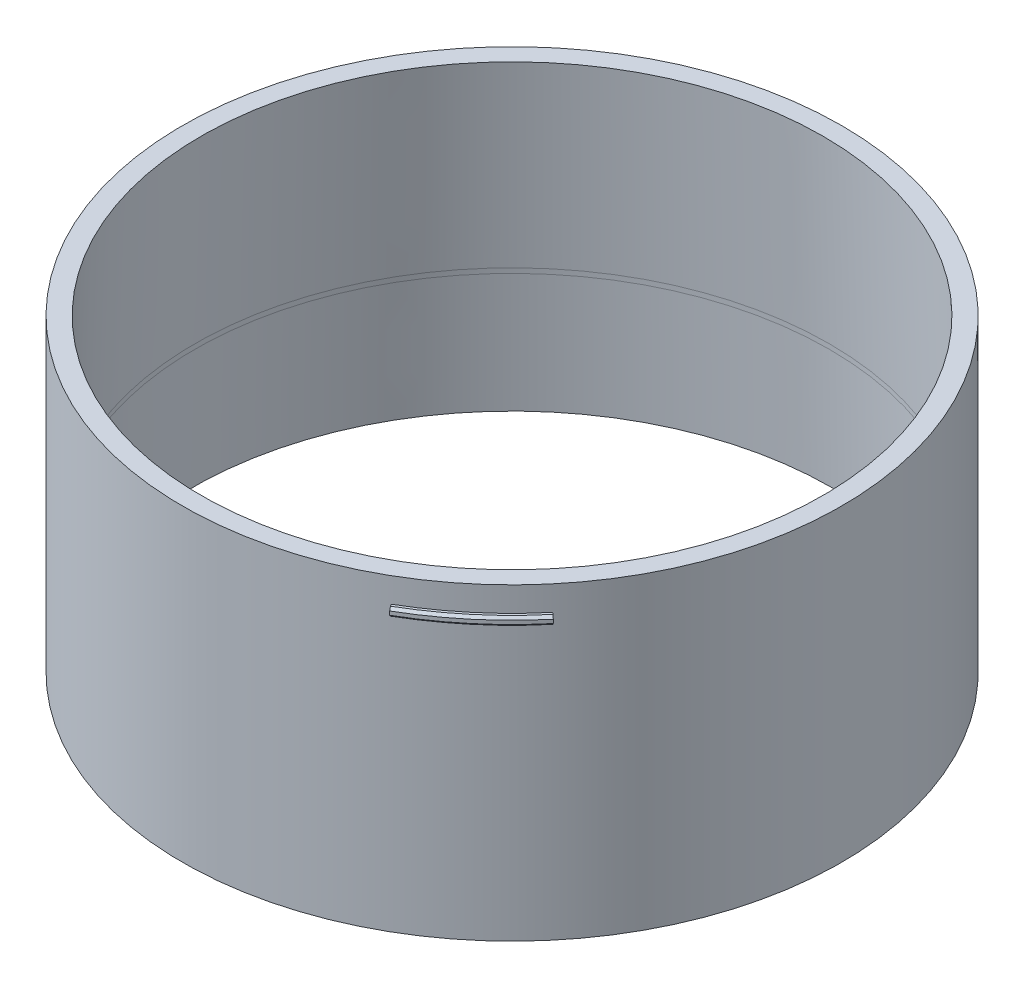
ISO-10303-21;
HEADER;
FILE_DESCRIPTION(('STEP AP214'),'2;1');
FILE_NAME('part.step','',(''),(''),'','','');
FILE_SCHEMA(('AUTOMOTIVE_DESIGN { 1 0 10303 214 1 1 1 1 }'));
ENDSEC;
DATA;
#1=APPLICATION_CONTEXT('core data for automotive mechanical design processes');
#2=APPLICATION_PROTOCOL_DEFINITION('international standard','automotive_design',2000,#1);
#3=PRODUCT_CONTEXT('',#1,'mechanical');
#4=PRODUCT('Part','Part','',(#3));
#5=PRODUCT_RELATED_PRODUCT_CATEGORY('part','',(#4));
#6=PRODUCT_DEFINITION_FORMATION('','',#4);
#7=PRODUCT_DEFINITION_CONTEXT('part definition',#1,'design');
#8=PRODUCT_DEFINITION('design','',#6,#7);
#9=PRODUCT_DEFINITION_SHAPE('','',#8);
#10=(LENGTH_UNIT() NAMED_UNIT(*) SI_UNIT(.MILLI.,.METRE.));
#11=(NAMED_UNIT(*) PLANE_ANGLE_UNIT() SI_UNIT($,.RADIAN.));
#12=(NAMED_UNIT(*) SI_UNIT($,.STERADIAN.) SOLID_ANGLE_UNIT());
#13=UNCERTAINTY_MEASURE_WITH_UNIT(LENGTH_MEASURE(1.E-05),#10,'distance_accuracy_value','');
#14=(GEOMETRIC_REPRESENTATION_CONTEXT(3) GLOBAL_UNCERTAINTY_ASSIGNED_CONTEXT((#13)) GLOBAL_UNIT_ASSIGNED_CONTEXT((#10,
#11,#12)) REPRESENTATION_CONTEXT('',''));
#15=CARTESIAN_POINT('',(0.,0.,0.));
#16=DIRECTION('',(0.,0.,1.));
#17=DIRECTION('',(1.,0.,0.));
#18=AXIS2_PLACEMENT_3D('',#15,#16,#17);
#19=CARTESIAN_POINT('',(0.,0.,0.));
#20=DIRECTION('',(0.,-1.,0.));
#21=DIRECTION('',(0.,0.,-1.));
#22=AXIS2_PLACEMENT_3D('',#19,#20,#21);
#23=CYLINDRICAL_SURFACE('',#22,26.7);
#24=CARTESIAN_POINT('',(0.,60.,0.));
#25=DIRECTION('',(0.,-1.,0.));
#26=DIRECTION('',(0.,0.,-1.));
#27=AXIS2_PLACEMENT_3D('',#24,#25,#26);
#28=CIRCLE('',#27,26.7);
#29=CARTESIAN_POINT('',(0.,60.,-26.7));
#30=VERTEX_POINT('',#29);
#31=EDGE_CURVE('E342',#30,#30,#28,.T.);
#32=ORIENTED_EDGE('',*,*,#31,.T.);
#33=EDGE_LOOP('',(#32));
#34=FACE_BOUND('',#33,.T.);
#35=CARTESIAN_POINT('',(0.,35.,0.));
#36=DIRECTION('',(0.,-1.,0.));
#37=DIRECTION('',(0.,0.,-1.));
#38=AXIS2_PLACEMENT_3D('',#35,#36,#37);
#39=CIRCLE('',#38,26.7);
#40=CARTESIAN_POINT('',(0.,35.,-26.7));
#41=VERTEX_POINT('',#40);
#42=EDGE_CURVE('E338',#41,#41,#39,.T.);
#43=ORIENTED_EDGE('',*,*,#42,.F.);
#44=EDGE_LOOP('',(#43));
#45=FACE_BOUND('',#44,.T.);
#46=CARTESIAN_POINT('',(0.,58.,0.));
#47=DIRECTION('',(0.,-1.,0.));
#48=DIRECTION('',(0.,0.,-1.));
#49=AXIS2_PLACEMENT_3D('',#46,#47,#48);
#50=CIRCLE('',#49,26.7);
#51=CARTESIAN_POINT('',(-26.7,58.,0.));
#52=VERTEX_POINT('',#51);
#53=CARTESIAN_POINT('',(-25.0897929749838,58.,9.13193782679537));
#54=VERTEX_POINT('',#53);
#55=EDGE_CURVE('E358',#52,#54,#50,.F.);
#56=ORIENTED_EDGE('',*,*,#55,.T.);
#57=DIRECTION('',(0.,-1.,0.));
#58=VECTOR('',#57,1.);
#59=CARTESIAN_POINT('',(-25.0897929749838,0.,9.13193782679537));
#60=LINE('',#59,#58);
#61=CARTESIAN_POINT('',(-25.0897929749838,57.3,9.13193782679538));
#62=VERTEX_POINT('',#61);
#63=EDGE_CURVE('E364',#54,#62,#60,.T.);
#64=ORIENTED_EDGE('',*,*,#63,.T.);
#65=CARTESIAN_POINT('',(0.,57.3,0.));
#66=DIRECTION('',(0.,1.,0.));
#67=DIRECTION('',(0.,0.,1.));
#68=AXIS2_PLACEMENT_3D('',#65,#66,#67);
#69=CIRCLE('',#68,26.7);
#70=CARTESIAN_POINT('',(-26.7,57.3,0.));
#71=VERTEX_POINT('',#70);
#72=EDGE_CURVE('E361',#62,#71,#69,.F.);
#73=ORIENTED_EDGE('',*,*,#72,.T.);
#74=DIRECTION('',(0.,-1.,0.));
#75=VECTOR('',#74,1.);
#76=CARTESIAN_POINT('',(-26.7,0.,0.));
#77=LINE('',#76,#75);
#78=EDGE_CURVE('E354',#52,#71,#77,.T.);
#79=ORIENTED_EDGE('',*,*,#78,.F.);
#80=EDGE_LOOP('',(#56,#64,#73,#79));
#81=FACE_BOUND('',#80,.T.);
#82=CARTESIAN_POINT('',(0.,58.,0.));
#83=DIRECTION('',(0.,-1.,0.));
#84=DIRECTION('',(0.,0.,-1.));
#85=AXIS2_PLACEMENT_3D('',#82,#83,#84);
#86=CIRCLE('',#85,26.7);
#87=CARTESIAN_POINT('',(13.3500000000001,58.,-23.1228782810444));
#88=VERTEX_POINT('',#87);
#89=CARTESIAN_POINT('',(4.63640634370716,58.,-26.2943670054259));
#90=VERTEX_POINT('',#89);
#91=EDGE_CURVE('E371',#88,#90,#86,.F.);
#92=ORIENTED_EDGE('',*,*,#91,.T.);
#93=DIRECTION('',(0.,-1.,0.));
#94=VECTOR('',#93,1.);
#95=CARTESIAN_POINT('',(4.63640634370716,0.,-26.2943670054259));
#96=LINE('',#95,#94);
#97=CARTESIAN_POINT('',(4.63640634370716,57.3,-26.2943670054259));
#98=VERTEX_POINT('',#97);
#99=EDGE_CURVE('E377',#90,#98,#96,.T.);
#100=ORIENTED_EDGE('',*,*,#99,.T.);
#101=CARTESIAN_POINT('',(0.,57.3,0.));
#102=DIRECTION('',(0.,1.,0.));
#103=DIRECTION('',(0.,0.,1.));
#104=AXIS2_PLACEMENT_3D('',#101,#102,#103);
#105=CIRCLE('',#104,26.7);
#106=CARTESIAN_POINT('',(13.3500000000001,57.3,-23.1228782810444));
#107=VERTEX_POINT('',#106);
#108=EDGE_CURVE('E374',#98,#107,#105,.F.);
#109=ORIENTED_EDGE('',*,*,#108,.T.);
#110=DIRECTION('',(0.,-1.,0.));
#111=VECTOR('',#110,1.);
#112=CARTESIAN_POINT('',(13.3500000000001,0.,-23.1228782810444));
#113=LINE('',#112,#111);
#114=EDGE_CURVE('E367',#88,#107,#113,.T.);
#115=ORIENTED_EDGE('',*,*,#114,.F.);
#116=EDGE_LOOP('',(#92,#100,#109,#115));
#117=FACE_BOUND('',#116,.T.);
#118=CARTESIAN_POINT('',(0.,58.,0.));
#119=DIRECTION('',(0.,-1.,0.));
#120=DIRECTION('',(0.,0.,-1.));
#121=AXIS2_PLACEMENT_3D('',#118,#119,#120);
#122=CIRCLE('',#121,26.7);
#123=CARTESIAN_POINT('',(13.3499999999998,58.,23.1228782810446));
#124=VERTEX_POINT('',#123);
#125=CARTESIAN_POINT('',(20.4533866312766,58.,17.1624291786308));
#126=VERTEX_POINT('',#125);
#127=EDGE_CURVE('E61',#124,#126,#122,.F.);
#128=ORIENTED_EDGE('',*,*,#127,.T.);
#129=DIRECTION('',(0.,-1.,0.));
#130=VECTOR('',#129,1.);
#131=CARTESIAN_POINT('',(20.4533866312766,0.,17.1624291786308));
#132=LINE('',#131,#130);
#133=CARTESIAN_POINT('',(20.4533866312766,57.3,17.1624291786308));
#134=VERTEX_POINT('',#133);
#135=EDGE_CURVE('E11',#126,#134,#132,.T.);
#136=ORIENTED_EDGE('',*,*,#135,.T.);
#137=CARTESIAN_POINT('',(0.,57.3,0.));
#138=DIRECTION('',(0.,1.,0.));
#139=DIRECTION('',(0.,0.,1.));
#140=AXIS2_PLACEMENT_3D('',#137,#138,#139);
#141=CIRCLE('',#140,26.7);
#142=CARTESIAN_POINT('',(13.3499999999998,57.3,23.1228782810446));
#143=VERTEX_POINT('',#142);
#144=EDGE_CURVE('E51',#134,#143,#141,.F.);
#145=ORIENTED_EDGE('',*,*,#144,.T.);
#146=DIRECTION('',(0.,-1.,0.));
#147=VECTOR('',#146,1.);
#148=CARTESIAN_POINT('',(13.3499999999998,0.,23.1228782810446));
#149=LINE('',#148,#147);
#150=EDGE_CURVE('E380',#124,#143,#149,.T.);
#151=ORIENTED_EDGE('',*,*,#150,.F.);
#152=EDGE_LOOP('',(#128,#136,#145,#151));
#153=FACE_BOUND('',#152,.T.);
#154=ADVANCED_FACE('F42',(#34,#45,#81,#117,#153),#23,.T.);
#155=CARTESIAN_POINT('',(25.2,60.,0.));
#156=DIRECTION('',(0.,1.,0.));
#157=DIRECTION('',(0.,0.,1.));
#158=AXIS2_PLACEMENT_3D('',#155,#156,#157);
#159=PLANE('',#158);
#160=CARTESIAN_POINT('',(0.,60.,0.));
#161=DIRECTION('',(0.,-1.,0.));
#162=DIRECTION('',(0.,0.,-1.));
#163=AXIS2_PLACEMENT_3D('',#160,#161,#162);
#164=CIRCLE('',#163,25.2);
#165=CARTESIAN_POINT('',(0.,60.,-25.2));
#166=VERTEX_POINT('',#165);
#167=EDGE_CURVE('E330',#166,#166,#164,.T.);
#168=ORIENTED_EDGE('',*,*,#167,.T.);
#169=EDGE_LOOP('',(#168));
#170=FACE_BOUND('',#169,.T.);
#171=ORIENTED_EDGE('',*,*,#31,.F.);
#172=EDGE_LOOP('',(#171));
#173=FACE_BOUND('',#172,.T.);
#174=ADVANCED_FACE('F407',(#170,#173),#159,.T.);
#175=CARTESIAN_POINT('',(25.9,35.,0.));
#176=DIRECTION('',(0.,-1.,0.));
#177=DIRECTION('',(0.,0.,-1.));
#178=AXIS2_PLACEMENT_3D('',#175,#176,#177);
#179=PLANE('',#178);
#180=ORIENTED_EDGE('',*,*,#42,.T.);
#181=EDGE_LOOP('',(#180));
#182=FACE_BOUND('',#181,.T.);
#183=CARTESIAN_POINT('',(0.,35.,0.));
#184=DIRECTION('',(0.,-1.,0.));
#185=DIRECTION('',(0.,0.,-1.));
#186=AXIS2_PLACEMENT_3D('',#183,#184,#185);
#187=CIRCLE('',#186,25.9);
#188=CARTESIAN_POINT('',(0.,35.,-25.9));
#189=VERTEX_POINT('',#188);
#190=EDGE_CURVE('E334',#189,#189,#187,.T.);
#191=ORIENTED_EDGE('',*,*,#190,.F.);
#192=EDGE_LOOP('',(#191));
#193=FACE_BOUND('',#192,.T.);
#194=ADVANCED_FACE('F413',(#182,#193),#179,.T.);
#195=CARTESIAN_POINT('',(0.,44.9979997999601,0.));
#196=DIRECTION('',(0.,-1.,0.));
#197=DIRECTION('',(0.,0.,-1.));
#198=AXIS2_PLACEMENT_3D('',#195,#196,#197);
#199=CONICAL_SURFACE('',#198,25.7,0.0200013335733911);
#200=CARTESIAN_POINT('',(0.,44.7983084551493,0.));
#201=DIRECTION('',(0.,-1.,0.));
#202=DIRECTION('',(0.,0.,-1.));
#203=AXIS2_PLACEMENT_3D('',#200,#201,#202);
#204=CIRCLE('',#203,25.7039946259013);
#205=CARTESIAN_POINT('',(0.,44.7983084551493,-25.7039946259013));
#206=VERTEX_POINT('',#205);
#207=EDGE_CURVE('E350',#206,#206,#204,.F.);
#208=ORIENTED_EDGE('',*,*,#207,.T.);
#209=EDGE_LOOP('',(#208));
#210=FACE_BOUND('',#209,.T.);
#211=ORIENTED_EDGE('',*,*,#190,.T.);
#212=EDGE_LOOP('',(#211));
#213=FACE_BOUND('',#212,.T.);
#214=ADVANCED_FACE('F419',(#210,#213),#199,.F.);
#215=CARTESIAN_POINT('',(0.,60.,0.));
#216=DIRECTION('',(0.,-1.,0.));
#217=DIRECTION('',(0.,0.,-1.));
#218=AXIS2_PLACEMENT_3D('',#215,#216,#217);
#219=CONICAL_SURFACE('',#218,25.2,0.033316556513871);
#220=CARTESIAN_POINT('',(0.,45.1976202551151,0.));
#221=DIRECTION('',(0.,-1.,0.));
#222=DIRECTION('',(0.,0.,-1.));
#223=AXIS2_PLACEMENT_3D('',#220,#221,#222);
#224=CIRCLE('',#223,25.6933468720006);
#225=CARTESIAN_POINT('',(0.,45.1976202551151,-25.6933468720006));
#226=VERTEX_POINT('',#225);
#227=EDGE_CURVE('E346',#226,#226,#224,.T.);
#228=ORIENTED_EDGE('',*,*,#227,.T.);
#229=EDGE_LOOP('',(#228));
#230=FACE_BOUND('',#229,.T.);
#231=ORIENTED_EDGE('',*,*,#167,.F.);
#232=EDGE_LOOP('',(#231));
#233=FACE_BOUND('',#232,.T.);
#234=ADVANCED_FACE('F423',(#230,#233),#219,.F.);
#235=CARTESIAN_POINT('',(0.,44.1983084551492,0.));
#236=DIRECTION('',(0.,-1.,0.));
#237=DIRECTION('',(0.,0.,-1.));
#238=AXIS2_PLACEMENT_3D('',#235,#236,#237);
#239=DEGENERATE_TOROIDAL_SURFACE('',#238,4.29000477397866,30.,.F.);
#240=ORIENTED_EDGE('',*,*,#207,.F.);
#241=EDGE_LOOP('',(#240));
#242=FACE_BOUND('',#241,.T.);
#243=ORIENTED_EDGE('',*,*,#227,.F.);
#244=EDGE_LOOP('',(#243));
#245=FACE_BOUND('',#244,.T.);
#246=ADVANCED_FACE('F44',(#242,#245),#239,.T.);
#247=CARTESIAN_POINT('',(-24.4469244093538,57.3,8.89795280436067));
#248=DIRECTION('',(0.,1.,0.));
#249=DIRECTION('',(0.,0.,1.));
#250=AXIS2_PLACEMENT_3D('',#247,#248,#249);
#251=PLANE('',#250);
#252=ORIENTED_EDGE('',*,*,#72,.F.);
#253=DIRECTION('',(0.939692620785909,0.,-0.342020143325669));
#254=VECTOR('',#253,1.);
#255=CARTESIAN_POINT('',(-24.4469244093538,57.3,8.89795280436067));
#256=LINE('',#255,#254);
#257=CARTESIAN_POINT('',(-25.277731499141,57.3,9.20034185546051));
#258=VERTEX_POINT('',#257);
#259=EDGE_CURVE('E313',#258,#62,#256,.T.);
#260=ORIENTED_EDGE('',*,*,#259,.F.);
#261=CARTESIAN_POINT('',(0.,57.3,0.));
#262=DIRECTION('',(0.,-1.,0.));
#263=DIRECTION('',(0.,0.,-1.));
#264=AXIS2_PLACEMENT_3D('',#261,#262,#263);
#265=CIRCLE('',#264,26.9);
#266=CARTESIAN_POINT('',(-26.9,57.3,0.));
#267=VERTEX_POINT('',#266);
#268=EDGE_CURVE('E327',#258,#267,#265,.T.);
#269=ORIENTED_EDGE('',*,*,#268,.T.);
#270=DIRECTION('',(1.,0.,0.));
#271=VECTOR('',#270,1.);
#272=CARTESIAN_POINT('',(-26.0158735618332,57.3,0.));
#273=LINE('',#272,#271);
#274=EDGE_CURVE('E294',#267,#71,#273,.T.);
#275=ORIENTED_EDGE('',*,*,#274,.T.);
#276=EDGE_LOOP('',(#252,#260,#269,#275));
#277=FACE_BOUND('',#276,.T.);
#278=ADVANCED_FACE('F428',(#277),#251,.F.);
#279=CARTESIAN_POINT('',(0.,57.5,0.));
#280=DIRECTION('',(0.,1.,0.));
#281=DIRECTION('',(0.,0.,1.));
#282=AXIS2_PLACEMENT_3D('',#279,#280,#281);
#283=CONICAL_SURFACE('',#282,27.1,0.785398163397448);
#284=CARTESIAN_POINT('',(0.,57.5,0.));
#285=DIRECTION('',(0.,-1.,0.));
#286=DIRECTION('',(0.,0.,-1.));
#287=AXIS2_PLACEMENT_3D('',#284,#285,#286);
#288=CIRCLE('',#287,27.1);
#289=CARTESIAN_POINT('',(-25.4656700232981,57.5,9.26874588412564));
#290=VERTEX_POINT('',#289);
#291=CARTESIAN_POINT('',(-27.1,57.5,0.));
#292=VERTEX_POINT('',#291);
#293=EDGE_CURVE('E324',#290,#292,#288,.T.);
#294=ORIENTED_EDGE('',*,*,#293,.T.);
#295=DIRECTION('',(0.707106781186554,-0.707106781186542,0.));
#296=VECTOR('',#295,1.);
#297=CARTESIAN_POINT('',(-26.9,57.3,0.));
#298=LINE('',#297,#296);
#299=EDGE_CURVE('E290',#292,#267,#298,.T.);
#300=ORIENTED_EDGE('',*,*,#299,.T.);
#301=ORIENTED_EDGE('',*,*,#268,.F.);
#302=DIRECTION('',(0.664463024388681,-0.707106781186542,-0.241844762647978));
#303=VECTOR('',#302,1.);
#304=CARTESIAN_POINT('',(-25.277731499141,57.3,9.20034185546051));
#305=LINE('',#304,#303);
#306=EDGE_CURVE('E309',#290,#258,#305,.T.);
#307=ORIENTED_EDGE('',*,*,#306,.F.);
#308=EDGE_LOOP('',(#294,#300,#301,#307));
#309=FACE_BOUND('',#308,.T.);
#310=ADVANCED_FACE('F431',(#309),#283,.T.);
#311=CARTESIAN_POINT('',(0.,54.1622707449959,0.));
#312=DIRECTION('',(0.,-1.,0.));
#313=DIRECTION('',(0.,0.,-1.));
#314=AXIS2_PLACEMENT_3D('',#311,#312,#313);
#315=CYLINDRICAL_SURFACE('',#314,27.1);
#316=CARTESIAN_POINT('',(0.,57.8,0.));
#317=DIRECTION('',(0.,-1.,0.));
#318=DIRECTION('',(0.,0.,-1.));
#319=AXIS2_PLACEMENT_3D('',#316,#317,#318);
#320=CIRCLE('',#319,27.1);
#321=CARTESIAN_POINT('',(-25.4656700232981,57.8,9.26874588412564));
#322=VERTEX_POINT('',#321);
#323=CARTESIAN_POINT('',(-27.1,57.8,0.));
#324=VERTEX_POINT('',#323);
#325=EDGE_CURVE('E321',#322,#324,#320,.T.);
#326=ORIENTED_EDGE('',*,*,#325,.T.);
#327=DIRECTION('',(0.,-1.,0.));
#328=VECTOR('',#327,1.);
#329=CARTESIAN_POINT('',(-27.1,57.8,0.));
#330=LINE('',#329,#328);
#331=EDGE_CURVE('E286',#324,#292,#330,.T.);
#332=ORIENTED_EDGE('',*,*,#331,.T.);
#333=ORIENTED_EDGE('',*,*,#293,.F.);
#334=DIRECTION('',(0.,-1.,0.));
#335=VECTOR('',#334,1.);
#336=CARTESIAN_POINT('',(-25.4656700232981,57.8,9.26874588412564));
#337=LINE('',#336,#335);
#338=EDGE_CURVE('E305',#322,#290,#337,.T.);
#339=ORIENTED_EDGE('',*,*,#338,.F.);
#340=EDGE_LOOP('',(#326,#332,#333,#339));
#341=FACE_BOUND('',#340,.T.);
#342=ADVANCED_FACE('F435',(#341),#315,.T.);
#343=CARTESIAN_POINT('',(0.,58.,0.));
#344=DIRECTION('',(0.,-1.,0.));
#345=DIRECTION('',(0.,0.,-1.));
#346=AXIS2_PLACEMENT_3D('',#343,#344,#345);
#347=CONICAL_SURFACE('',#346,26.9,0.785398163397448);
#348=CARTESIAN_POINT('',(0.,58.,0.));
#349=DIRECTION('',(0.,-1.,0.));
#350=DIRECTION('',(0.,0.,-1.));
#351=AXIS2_PLACEMENT_3D('',#348,#349,#350);
#352=CIRCLE('',#351,26.9);
#353=CARTESIAN_POINT('',(-25.277731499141,58.,9.2003418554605));
#354=VERTEX_POINT('',#353);
#355=CARTESIAN_POINT('',(-26.9,58.0000000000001,0.));
#356=VERTEX_POINT('',#355);
#357=EDGE_CURVE('E317',#354,#356,#352,.T.);
#358=ORIENTED_EDGE('',*,*,#357,.T.);
#359=DIRECTION('',(-0.707106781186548,-0.707106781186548,0.));
#360=VECTOR('',#359,1.);
#361=CARTESIAN_POINT('',(-26.9,58.0000000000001,0.));
#362=LINE('',#361,#360);
#363=EDGE_CURVE('E282',#356,#324,#362,.T.);
#364=ORIENTED_EDGE('',*,*,#363,.T.);
#365=ORIENTED_EDGE('',*,*,#325,.F.);
#366=DIRECTION('',(-0.664463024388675,-0.707106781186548,0.241844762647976));
#367=VECTOR('',#366,1.);
#368=CARTESIAN_POINT('',(-25.277731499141,58.,9.2003418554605));
#369=LINE('',#368,#367);
#370=EDGE_CURVE('E301',#354,#322,#369,.T.);
#371=ORIENTED_EDGE('',*,*,#370,.F.);
#372=EDGE_LOOP('',(#358,#364,#365,#371));
#373=FACE_BOUND('',#372,.T.);
#374=ADVANCED_FACE('F439',(#373),#347,.T.);
#375=CARTESIAN_POINT('',(-25.277731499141,58.,9.2003418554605));
#376=DIRECTION('',(0.,-1.,0.));
#377=DIRECTION('',(0.,0.,-1.));
#378=AXIS2_PLACEMENT_3D('',#375,#376,#377);
#379=PLANE('',#378);
#380=ORIENTED_EDGE('',*,*,#55,.F.);
#381=DIRECTION('',(-1.,0.,0.));
#382=VECTOR('',#381,1.);
#383=CARTESIAN_POINT('',(-26.9,58.0000000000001,0.));
#384=LINE('',#383,#382);
#385=EDGE_CURVE('E279',#52,#356,#384,.T.);
#386=ORIENTED_EDGE('',*,*,#385,.T.);
#387=ORIENTED_EDGE('',*,*,#357,.F.);
#388=DIRECTION('',(-0.939692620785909,0.,0.342020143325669));
#389=VECTOR('',#388,1.);
#390=CARTESIAN_POINT('',(-25.277731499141,58.,9.2003418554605));
#391=LINE('',#390,#389);
#392=EDGE_CURVE('E298',#54,#354,#391,.T.);
#393=ORIENTED_EDGE('',*,*,#392,.F.);
#394=EDGE_LOOP('',(#380,#386,#387,#393));
#395=FACE_BOUND('',#394,.T.);
#396=ADVANCED_FACE('F443',(#395),#379,.F.);
#397=CARTESIAN_POINT('',(0.,0.,0.));
#398=DIRECTION('',(-0.342020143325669,0.,-0.939692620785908));
#399=DIRECTION('',(-0.939692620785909,0.,0.342020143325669));
#400=AXIS2_PLACEMENT_3D('',#397,#398,#399);
#401=PLANE('',#400);
#402=ORIENTED_EDGE('',*,*,#63,.F.);
#403=ORIENTED_EDGE('',*,*,#392,.T.);
#404=ORIENTED_EDGE('',*,*,#370,.T.);
#405=ORIENTED_EDGE('',*,*,#338,.T.);
#406=ORIENTED_EDGE('',*,*,#306,.T.);
#407=ORIENTED_EDGE('',*,*,#259,.T.);
#408=EDGE_LOOP('',(#402,#403,#404,#405,#406,#407));
#409=FACE_BOUND('',#408,.T.);
#410=ADVANCED_FACE('F447',(#409),#401,.F.);
#411=CARTESIAN_POINT('',(0.,0.,0.));
#412=DIRECTION('',(0.,0.,-1.));
#413=DIRECTION('',(-1.,0.,0.));
#414=AXIS2_PLACEMENT_3D('',#411,#412,#413);
#415=PLANE('',#414);
#416=ORIENTED_EDGE('',*,*,#385,.F.);
#417=ORIENTED_EDGE('',*,*,#78,.T.);
#418=ORIENTED_EDGE('',*,*,#274,.F.);
#419=ORIENTED_EDGE('',*,*,#299,.F.);
#420=ORIENTED_EDGE('',*,*,#331,.F.);
#421=ORIENTED_EDGE('',*,*,#363,.F.);
#422=EDGE_LOOP('',(#416,#417,#418,#419,#420,#421));
#423=FACE_BOUND('',#422,.T.);
#424=ADVANCED_FACE('F451',(#423),#415,.T.);
#425=CARTESIAN_POINT('',(4.51760903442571,57.3,-25.6206339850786));
#426=DIRECTION('',(0.,1.,0.));
#427=DIRECTION('',(-0.866025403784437,0.,-0.500000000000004));
#428=AXIS2_PLACEMENT_3D('',#425,#426,#427);
#429=PLANE('',#428);
#430=ORIENTED_EDGE('',*,*,#108,.F.);
#431=DIRECTION('',(-0.173648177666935,0.,0.984807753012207));
#432=VECTOR('',#431,1.);
#433=CARTESIAN_POINT('',(4.51760903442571,57.3,-25.6206339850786));
#434=LINE('',#433,#432);
#435=CARTESIAN_POINT('',(4.67113597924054,57.3,-26.4913285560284));
#436=VERTEX_POINT('',#435);
#437=EDGE_CURVE('E262',#436,#98,#434,.T.);
#438=ORIENTED_EDGE('',*,*,#437,.F.);
#439=CARTESIAN_POINT('',(0.,57.3,0.));
#440=DIRECTION('',(0.,-1.,0.));
#441=DIRECTION('',(0.866025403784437,0.,0.500000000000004));
#442=AXIS2_PLACEMENT_3D('',#439,#440,#441);
#443=CIRCLE('',#442,26.9);
#444=CARTESIAN_POINT('',(13.4500000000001,57.3,-23.2960833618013));
#445=VERTEX_POINT('',#444);
#446=EDGE_CURVE('E276',#436,#445,#443,.T.);
#447=ORIENTED_EDGE('',*,*,#446,.T.);
#448=DIRECTION('',(-0.500000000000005,0.,0.866025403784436));
#449=VECTOR('',#448,1.);
#450=CARTESIAN_POINT('',(13.0079367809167,57.3,-22.5304074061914));
#451=LINE('',#450,#449);
#452=EDGE_CURVE('E243',#445,#107,#451,.T.);
#453=ORIENTED_EDGE('',*,*,#452,.T.);
#454=EDGE_LOOP('',(#430,#438,#447,#453));
#455=FACE_BOUND('',#454,.T.);
#456=ADVANCED_FACE('F455',(#455),#429,.F.);
#457=CARTESIAN_POINT('',(0.,57.5,0.));
#458=DIRECTION('',(0.,1.,0.));
#459=DIRECTION('',(-0.866025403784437,0.,-0.500000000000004));
#460=AXIS2_PLACEMENT_3D('',#457,#458,#459);
#461=CONICAL_SURFACE('',#460,27.1,0.785398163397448);
#462=CARTESIAN_POINT('',(0.,57.5,0.));
#463=DIRECTION('',(0.,-1.,0.));
#464=DIRECTION('',(0.866025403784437,0.,0.500000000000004));
#465=AXIS2_PLACEMENT_3D('',#462,#463,#464);
#466=CIRCLE('',#465,27.1);
#467=CARTESIAN_POINT('',(4.70586561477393,57.5,-26.6882901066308));
#468=VERTEX_POINT('',#467);
#469=CARTESIAN_POINT('',(13.5500000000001,57.5,-23.4692884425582));
#470=VERTEX_POINT('',#469);
#471=EDGE_CURVE('E273',#468,#470,#466,.T.);
#472=ORIENTED_EDGE('',*,*,#471,.T.);
#473=DIRECTION('',(-0.35355339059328,-0.707106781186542,0.612372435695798));
#474=VECTOR('',#473,1.);
#475=CARTESIAN_POINT('',(13.4500000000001,57.3,-23.2960833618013));
#476=LINE('',#475,#474);
#477=EDGE_CURVE('E239',#470,#445,#476,.T.);
#478=ORIENTED_EDGE('',*,*,#477,.T.);
#479=ORIENTED_EDGE('',*,*,#446,.F.);
#480=DIRECTION('',(-0.122787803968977,-0.707106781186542,0.696364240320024));
#481=VECTOR('',#480,1.);
#482=CARTESIAN_POINT('',(4.67113597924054,57.3,-26.4913285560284));
#483=LINE('',#482,#481);
#484=EDGE_CURVE('E258',#468,#436,#483,.T.);
#485=ORIENTED_EDGE('',*,*,#484,.F.);
#486=EDGE_LOOP('',(#472,#478,#479,#485));
#487=FACE_BOUND('',#486,.T.);
#488=ADVANCED_FACE('F459',(#487),#461,.T.);
#489=CARTESIAN_POINT('',(0.,54.1622707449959,0.));
#490=DIRECTION('',(0.,-1.,0.));
#491=DIRECTION('',(0.866025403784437,0.,0.500000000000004));
#492=AXIS2_PLACEMENT_3D('',#489,#490,#491);
#493=CYLINDRICAL_SURFACE('',#492,27.1);
#494=CARTESIAN_POINT('',(0.,57.8,0.));
#495=DIRECTION('',(0.,-1.,0.));
#496=DIRECTION('',(0.866025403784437,0.,0.500000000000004));
#497=AXIS2_PLACEMENT_3D('',#494,#495,#496);
#498=CIRCLE('',#497,27.1);
#499=CARTESIAN_POINT('',(4.70586561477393,57.8,-26.6882901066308));
#500=VERTEX_POINT('',#499);
#501=CARTESIAN_POINT('',(13.5500000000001,57.8,-23.4692884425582));
#502=VERTEX_POINT('',#501);
#503=EDGE_CURVE('E270',#500,#502,#498,.T.);
#504=ORIENTED_EDGE('',*,*,#503,.T.);
#505=DIRECTION('',(0.,-1.,0.));
#506=VECTOR('',#505,1.);
#507=CARTESIAN_POINT('',(13.5500000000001,57.8,-23.4692884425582));
#508=LINE('',#507,#506);
#509=EDGE_CURVE('E235',#502,#470,#508,.T.);
#510=ORIENTED_EDGE('',*,*,#509,.T.);
#511=ORIENTED_EDGE('',*,*,#471,.F.);
#512=DIRECTION('',(0.,-1.,0.));
#513=VECTOR('',#512,1.);
#514=CARTESIAN_POINT('',(4.70586561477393,57.8,-26.6882901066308));
#515=LINE('',#514,#513);
#516=EDGE_CURVE('E254',#500,#468,#515,.T.);
#517=ORIENTED_EDGE('',*,*,#516,.F.);
#518=EDGE_LOOP('',(#504,#510,#511,#517));
#519=FACE_BOUND('',#518,.T.);
#520=ADVANCED_FACE('F463',(#519),#493,.T.);
#521=CARTESIAN_POINT('',(0.,58.,0.));
#522=DIRECTION('',(0.,-1.,0.));
#523=DIRECTION('',(0.866025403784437,0.,0.500000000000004));
#524=AXIS2_PLACEMENT_3D('',#521,#522,#523);
#525=CONICAL_SURFACE('',#524,26.9,0.785398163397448);
#526=CARTESIAN_POINT('',(0.,58.,0.));
#527=DIRECTION('',(0.,-1.,0.));
#528=DIRECTION('',(0.866025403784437,0.,0.500000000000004));
#529=AXIS2_PLACEMENT_3D('',#526,#527,#528);
#530=CIRCLE('',#529,26.9);
#531=CARTESIAN_POINT('',(4.67113597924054,58.,-26.4913285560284));
#532=VERTEX_POINT('',#531);
#533=CARTESIAN_POINT('',(13.4500000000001,58.,-23.2960833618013));
#534=VERTEX_POINT('',#533);
#535=EDGE_CURVE('E266',#532,#534,#530,.T.);
#536=ORIENTED_EDGE('',*,*,#535,.T.);
#537=DIRECTION('',(0.353553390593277,-0.707106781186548,-0.612372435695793));
#538=VECTOR('',#537,1.);
#539=CARTESIAN_POINT('',(13.4500000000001,58.,-23.2960833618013));
#540=LINE('',#539,#538);
#541=EDGE_CURVE('E231',#534,#502,#540,.T.);
#542=ORIENTED_EDGE('',*,*,#541,.T.);
#543=ORIENTED_EDGE('',*,*,#503,.F.);
#544=DIRECTION('',(0.122787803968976,-0.707106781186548,-0.696364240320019));
#545=VECTOR('',#544,1.);
#546=CARTESIAN_POINT('',(4.67113597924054,58.,-26.4913285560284));
#547=LINE('',#546,#545);
#548=EDGE_CURVE('E250',#532,#500,#547,.T.);
#549=ORIENTED_EDGE('',*,*,#548,.F.);
#550=EDGE_LOOP('',(#536,#542,#543,#549));
#551=FACE_BOUND('',#550,.T.);
#552=ADVANCED_FACE('F467',(#551),#525,.T.);
#553=CARTESIAN_POINT('',(4.67113597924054,58.,-26.4913285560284));
#554=DIRECTION('',(0.,-1.,0.));
#555=DIRECTION('',(0.866025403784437,0.,0.500000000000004));
#556=AXIS2_PLACEMENT_3D('',#553,#554,#555);
#557=PLANE('',#556);
#558=ORIENTED_EDGE('',*,*,#91,.F.);
#559=DIRECTION('',(0.500000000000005,0.,-0.866025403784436));
#560=VECTOR('',#559,1.);
#561=CARTESIAN_POINT('',(13.4500000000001,58.,-23.2960833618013));
#562=LINE('',#561,#560);
#563=EDGE_CURVE('E228',#88,#534,#562,.T.);
#564=ORIENTED_EDGE('',*,*,#563,.T.);
#565=ORIENTED_EDGE('',*,*,#535,.F.);
#566=DIRECTION('',(0.173648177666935,0.,-0.984807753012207));
#567=VECTOR('',#566,1.);
#568=CARTESIAN_POINT('',(4.67113597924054,58.,-26.4913285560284));
#569=LINE('',#568,#567);
#570=EDGE_CURVE('E247',#90,#532,#569,.T.);
#571=ORIENTED_EDGE('',*,*,#570,.F.);
#572=EDGE_LOOP('',(#558,#564,#565,#571));
#573=FACE_BOUND('',#572,.T.);
#574=ADVANCED_FACE('F471',(#573),#557,.F.);
#575=CARTESIAN_POINT('',(0.,0.,0.));
#576=DIRECTION('',(0.984807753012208,0.,0.173648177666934));
#577=DIRECTION('',(0.173648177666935,0.,-0.984807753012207));
#578=AXIS2_PLACEMENT_3D('',#575,#576,#577);
#579=PLANE('',#578);
#580=ORIENTED_EDGE('',*,*,#99,.F.);
#581=ORIENTED_EDGE('',*,*,#570,.T.);
#582=ORIENTED_EDGE('',*,*,#548,.T.);
#583=ORIENTED_EDGE('',*,*,#516,.T.);
#584=ORIENTED_EDGE('',*,*,#484,.T.);
#585=ORIENTED_EDGE('',*,*,#437,.T.);
#586=EDGE_LOOP('',(#580,#581,#582,#583,#584,#585));
#587=FACE_BOUND('',#586,.T.);
#588=ADVANCED_FACE('F475',(#587),#579,.F.);
#589=CARTESIAN_POINT('',(0.,0.,0.));
#590=DIRECTION('',(0.866025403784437,0.,0.500000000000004));
#591=DIRECTION('',(0.500000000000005,0.,-0.866025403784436));
#592=AXIS2_PLACEMENT_3D('',#589,#590,#591);
#593=PLANE('',#592);
#594=ORIENTED_EDGE('',*,*,#563,.F.);
#595=ORIENTED_EDGE('',*,*,#114,.T.);
#596=ORIENTED_EDGE('',*,*,#452,.F.);
#597=ORIENTED_EDGE('',*,*,#477,.F.);
#598=ORIENTED_EDGE('',*,*,#509,.F.);
#599=ORIENTED_EDGE('',*,*,#541,.F.);
#600=EDGE_LOOP('',(#594,#595,#596,#597,#598,#599));
#601=FACE_BOUND('',#600,.T.);
#602=ADVANCED_FACE('F479',(#601),#593,.T.);
#603=CARTESIAN_POINT('',(19.9293153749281,57.3,16.7226811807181));
#604=DIRECTION('',(0.,1.,0.));
#605=DIRECTION('',(0.866025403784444,0.,-0.499999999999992));
#606=AXIS2_PLACEMENT_3D('',#603,#604,#605);
#607=PLANE('',#606);
#608=ORIENTED_EDGE('',*,*,#144,.F.);
#609=DIRECTION('',(-0.766044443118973,0.,-0.642787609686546));
#610=VECTOR('',#609,1.);
#611=CARTESIAN_POINT('',(19.9293153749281,57.3,16.7226811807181));
#612=LINE('',#611,#610);
#613=CARTESIAN_POINT('',(20.6065955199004,57.3,17.2909867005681));
#614=VERTEX_POINT('',#613);
#615=EDGE_CURVE('E184',#614,#134,#612,.T.);
#616=ORIENTED_EDGE('',*,*,#615,.F.);
#617=CARTESIAN_POINT('',(0.,57.3,0.));
#618=DIRECTION('',(0.,-1.,0.));
#619=DIRECTION('',(-0.866025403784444,0.,0.499999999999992));
#620=AXIS2_PLACEMENT_3D('',#617,#618,#619);
#621=CIRCLE('',#620,26.9);
#622=CARTESIAN_POINT('',(13.4499999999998,57.3,23.2960833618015));
#623=VERTEX_POINT('',#622);
#624=EDGE_CURVE('E225',#614,#623,#621,.T.);
#625=ORIENTED_EDGE('',*,*,#624,.T.);
#626=DIRECTION('',(-0.499999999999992,0.,-0.866025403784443));
#627=VECTOR('',#626,1.);
#628=CARTESIAN_POINT('',(13.0079367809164,57.3,22.5304074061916));
#629=LINE('',#628,#627);
#630=EDGE_CURVE('E200',#623,#143,#629,.T.);
#631=ORIENTED_EDGE('',*,*,#630,.T.);
#632=EDGE_LOOP('',(#608,#616,#625,#631));
#633=FACE_BOUND('',#632,.T.);
#634=ADVANCED_FACE('F389',(#633),#607,.F.);
#635=CARTESIAN_POINT('',(0.,57.5,0.));
#636=DIRECTION('',(0.,1.,0.));
#637=DIRECTION('',(0.866025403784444,0.,-0.499999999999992));
#638=AXIS2_PLACEMENT_3D('',#635,#636,#637);
#639=CONICAL_SURFACE('',#638,27.1,0.785398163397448);
#640=CARTESIAN_POINT('',(0.,57.5,0.));
#641=DIRECTION('',(0.,-1.,0.));
#642=DIRECTION('',(-0.866025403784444,0.,0.499999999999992));
#643=AXIS2_PLACEMENT_3D('',#640,#641,#642);
#644=CIRCLE('',#643,27.1);
#645=CARTESIAN_POINT('',(20.7598044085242,57.5,17.4195442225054));
#646=VERTEX_POINT('',#645);
#647=CARTESIAN_POINT('',(13.5499999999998,57.5,23.4692884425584));
#648=VERTEX_POINT('',#647);
#649=EDGE_CURVE('E222',#646,#648,#644,.T.);
#650=ORIENTED_EDGE('',*,*,#649,.T.);
#651=DIRECTION('',(-0.353553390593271,-0.707106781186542,-0.612372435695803));
#652=VECTOR('',#651,1.);
#653=CARTESIAN_POINT('',(13.4499999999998,57.3,23.2960833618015));
#654=LINE('',#653,#652);
#655=EDGE_CURVE('E194',#648,#623,#654,.T.);
#656=ORIENTED_EDGE('',*,*,#655,.T.);
#657=ORIENTED_EDGE('',*,*,#624,.F.);
#658=DIRECTION('',(-0.541675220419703,-0.707106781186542,-0.454519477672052));
#659=VECTOR('',#658,1.);
#660=CARTESIAN_POINT('',(20.6065955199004,57.3,17.2909867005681));
#661=LINE('',#660,#659);
#662=EDGE_CURVE('E213',#646,#614,#661,.T.);
#663=ORIENTED_EDGE('',*,*,#662,.F.);
#664=EDGE_LOOP('',(#650,#656,#657,#663));
#665=FACE_BOUND('',#664,.T.);
#666=ADVANCED_FACE('F392',(#665),#639,.T.);
#667=CARTESIAN_POINT('',(0.,54.1622707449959,0.));
#668=DIRECTION('',(0.,-1.,0.));
#669=DIRECTION('',(-0.866025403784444,0.,0.499999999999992));
#670=AXIS2_PLACEMENT_3D('',#667,#668,#669);
#671=CYLINDRICAL_SURFACE('',#670,27.1);
#672=CARTESIAN_POINT('',(0.,57.8,0.));
#673=DIRECTION('',(0.,-1.,0.));
#674=DIRECTION('',(-0.866025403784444,0.,0.499999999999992));
#675=AXIS2_PLACEMENT_3D('',#672,#673,#674);
#676=CIRCLE('',#675,27.1);
#677=CARTESIAN_POINT('',(20.7598044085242,57.8,17.4195442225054));
#678=VERTEX_POINT('',#677);
#679=CARTESIAN_POINT('',(13.5499999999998,57.8,23.4692884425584));
#680=VERTEX_POINT('',#679);
#681=EDGE_CURVE('E183',#678,#680,#676,.T.);
#682=ORIENTED_EDGE('',*,*,#681,.T.);
#683=DIRECTION('',(0.,-1.,0.));
#684=VECTOR('',#683,1.);
#685=CARTESIAN_POINT('',(13.5499999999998,57.8,23.4692884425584));
#686=LINE('',#685,#684);
#687=EDGE_CURVE('E189',#680,#648,#686,.T.);
#688=ORIENTED_EDGE('',*,*,#687,.T.);
#689=ORIENTED_EDGE('',*,*,#649,.F.);
#690=DIRECTION('',(0.,-1.,0.));
#691=VECTOR('',#690,1.);
#692=CARTESIAN_POINT('',(20.7598044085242,57.8,17.4195442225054));
#693=LINE('',#692,#691);
#694=EDGE_CURVE('E209',#678,#646,#693,.T.);
#695=ORIENTED_EDGE('',*,*,#694,.F.);
#696=EDGE_LOOP('',(#682,#688,#689,#695));
#697=FACE_BOUND('',#696,.T.);
#698=ADVANCED_FACE('F395',(#697),#671,.T.);
#699=CARTESIAN_POINT('',(0.,58.,0.));
#700=DIRECTION('',(0.,-1.,0.));
#701=DIRECTION('',(-0.866025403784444,0.,0.499999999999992));
#702=AXIS2_PLACEMENT_3D('',#699,#700,#701);
#703=CONICAL_SURFACE('',#702,26.9,0.785398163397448);
#704=CARTESIAN_POINT('',(0.,58.,0.));
#705=DIRECTION('',(0.,-1.,0.));
#706=DIRECTION('',(-0.866025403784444,0.,0.499999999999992));
#707=AXIS2_PLACEMENT_3D('',#704,#705,#706);
#708=CIRCLE('',#707,26.9);
#709=CARTESIAN_POINT('',(20.6065955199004,58.,17.2909867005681));
#710=VERTEX_POINT('',#709);
#711=CARTESIAN_POINT('',(13.4499999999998,58.,23.2960833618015));
#712=VERTEX_POINT('',#711);
#713=EDGE_CURVE('E168',#710,#712,#708,.T.);
#714=ORIENTED_EDGE('',*,*,#713,.T.);
#715=DIRECTION('',(0.353553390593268,-0.707106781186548,0.612372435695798));
#716=VECTOR('',#715,1.);
#717=CARTESIAN_POINT('',(13.4499999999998,58.,23.2960833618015));
#718=LINE('',#717,#716);
#719=EDGE_CURVE('E174',#712,#680,#718,.T.);
#720=ORIENTED_EDGE('',*,*,#719,.T.);
#721=ORIENTED_EDGE('',*,*,#681,.F.);
#722=DIRECTION('',(0.541675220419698,-0.707106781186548,0.454519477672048));
#723=VECTOR('',#722,1.);
#724=CARTESIAN_POINT('',(20.6065955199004,58.,17.2909867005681));
#725=LINE('',#724,#723);
#726=EDGE_CURVE('E181',#710,#678,#725,.T.);
#727=ORIENTED_EDGE('',*,*,#726,.F.);
#728=EDGE_LOOP('',(#714,#720,#721,#727));
#729=FACE_BOUND('',#728,.T.);
#730=ADVANCED_FACE('F178',(#729),#703,.T.);
#731=CARTESIAN_POINT('',(20.6065955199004,58.,17.2909867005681));
#732=DIRECTION('',(0.,-1.,0.));
#733=DIRECTION('',(-0.866025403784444,0.,0.499999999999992));
#734=AXIS2_PLACEMENT_3D('',#731,#732,#733);
#735=PLANE('',#734);
#736=ORIENTED_EDGE('',*,*,#127,.F.);
#737=DIRECTION('',(0.499999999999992,0.,0.866025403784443));
#738=VECTOR('',#737,1.);
#739=CARTESIAN_POINT('',(13.4499999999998,58.,23.2960833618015));
#740=LINE('',#739,#738);
#741=EDGE_CURVE('E164',#124,#712,#740,.T.);
#742=ORIENTED_EDGE('',*,*,#741,.T.);
#743=ORIENTED_EDGE('',*,*,#713,.F.);
#744=DIRECTION('',(0.766044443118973,0.,0.642787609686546));
#745=VECTOR('',#744,1.);
#746=CARTESIAN_POINT('',(20.6065955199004,58.,17.2909867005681));
#747=LINE('',#746,#745);
#748=EDGE_CURVE('E204',#126,#710,#747,.T.);
#749=ORIENTED_EDGE('',*,*,#748,.F.);
#750=EDGE_LOOP('',(#736,#742,#743,#749));
#751=FACE_BOUND('',#750,.T.);
#752=ADVANCED_FACE('F166',(#751),#735,.F.);
#753=CARTESIAN_POINT('',(0.,0.,0.));
#754=DIRECTION('',(-0.642787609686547,0.,0.766044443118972));
#755=DIRECTION('',(0.766044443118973,0.,0.642787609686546));
#756=AXIS2_PLACEMENT_3D('',#753,#754,#755);
#757=PLANE('',#756);
#758=ORIENTED_EDGE('',*,*,#135,.F.);
#759=ORIENTED_EDGE('',*,*,#748,.T.);
#760=ORIENTED_EDGE('',*,*,#726,.T.);
#761=ORIENTED_EDGE('',*,*,#694,.T.);
#762=ORIENTED_EDGE('',*,*,#662,.T.);
#763=ORIENTED_EDGE('',*,*,#615,.T.);
#764=EDGE_LOOP('',(#758,#759,#760,#761,#762,#763));
#765=FACE_BOUND('',#764,.T.);
#766=ADVANCED_FACE('F397',(#765),#757,.F.);
#767=CARTESIAN_POINT('',(0.,0.,0.));
#768=DIRECTION('',(-0.866025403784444,0.,0.499999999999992));
#769=DIRECTION('',(0.499999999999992,0.,0.866025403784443));
#770=AXIS2_PLACEMENT_3D('',#767,#768,#769);
#771=PLANE('',#770);
#772=ORIENTED_EDGE('',*,*,#741,.F.);
#773=ORIENTED_EDGE('',*,*,#150,.T.);
#774=ORIENTED_EDGE('',*,*,#630,.F.);
#775=ORIENTED_EDGE('',*,*,#655,.F.);
#776=ORIENTED_EDGE('',*,*,#687,.F.);
#777=ORIENTED_EDGE('',*,*,#719,.F.);
#778=EDGE_LOOP('',(#772,#773,#774,#775,#776,#777));
#779=FACE_BOUND('',#778,.T.);
#780=ADVANCED_FACE('F186',(#779),#771,.T.);
#781=CLOSED_SHELL('',(#154,#174,#194,#214,#234,#246,#278,#310,#342,#374,#396,#410,#424,#456,
#488,#520,#552,#574,#588,#602,#634,#666,#698,#730,#752,#766,#780));
#782=MANIFOLD_SOLID_BREP('B2',#781);
#783=ADVANCED_BREP_SHAPE_REPRESENTATION('',(#18,#782),#14);
#784=SHAPE_DEFINITION_REPRESENTATION(#9,#783);
ENDSEC;
END-ISO-10303-21;
